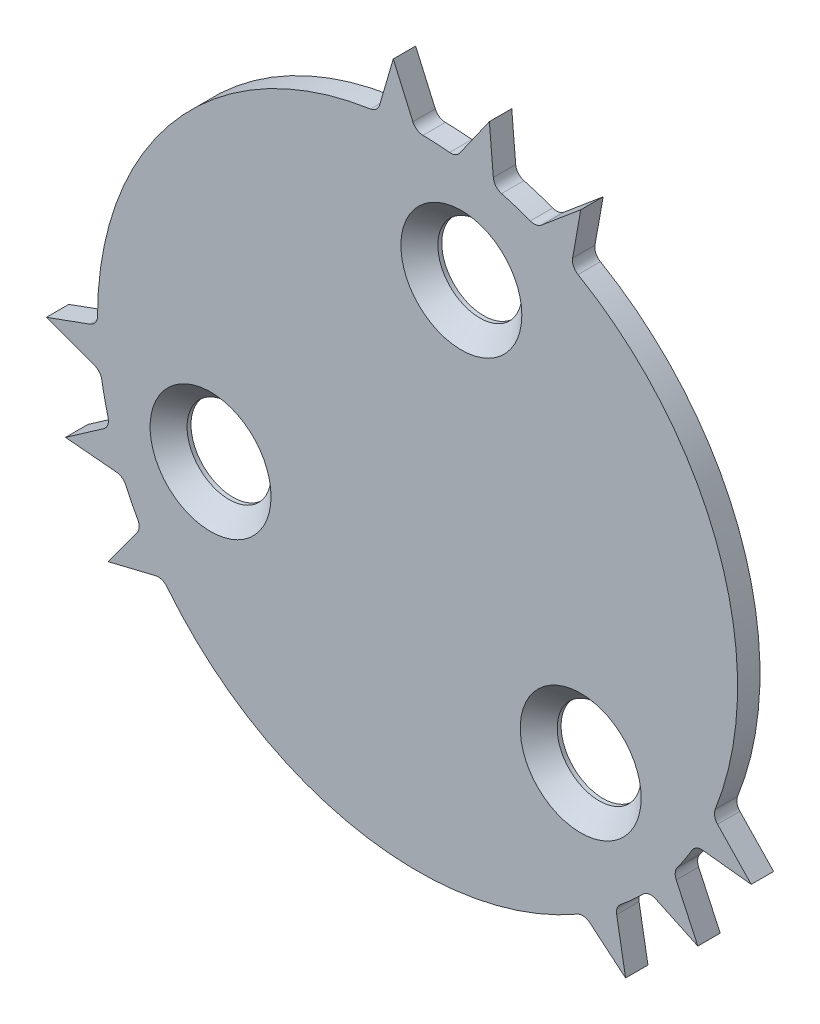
from build123d import *

# Parameters (mm, degrees)
SKIZZE1_R                     = 28.582568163
LINEAR_AUSTRAGEN2_DEPTH       = 2
LINEAR_START                  = -2
LINEAR_AUSTRAGEN3_DEPTH       = 2
VERRUNDUNG1_R                 = 1
KREISMUSTER5_COUNT            = 3
VERRUNDUNG1_OF_KREISMUSTER5_R = 1


with BuildPart() as part:
    # Skizze1 → Linear austragen2 (new body)
    with BuildSketch(Plane.XY):
        Circle(SKIZZE1_R)
    extrude(amount=LINEAR_AUSTRAGEN2_DEPTH)

    # Skizze5 → Formsenkung f_r M5 SFHCS2 (revolve, cut)
    with BuildSketch(Plane(origin=(3.912466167, 19.084414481, 2), x_dir=(0, -1, 0), z_dir=(1, 0, 0))):
        Polygon((0, 0), (0, 2), (3.75, 2), (3.75, 1.65), (5.4, 0), align=None)
    formsenkung_f_r_m5_sfhcs2 = revolve(axis=Axis((3.912466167, 19.084414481, 8.35), (0, 0, -1)), mode=Mode.SUBTRACT)

    # Skizze6 → Linear austragen3 (add)
    with BuildSketch(Plane.XY.offset(2).offset(LINEAR_START)):
        with BuildLine():
            Line((14.571015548, 29.864811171), (13.725776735, 25.07122366))
            ThreePointArc((13.725776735, 25.07122366), (12.189743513, 25.852917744), (10.609388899, 26.540611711))
            Line((10.609388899, 26.540611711), (14.571015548, 29.864811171))
        make_face()
        with BuildLine():
            Line((6.41322251, 32.605091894), (6.827302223, 27.755200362))
            ThreePointArc((6.827302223, 27.755200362), (5.142043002, 28.116233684), (3.43808753, 28.375037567))
            Line((3.43808753, 28.375037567), (6.41322251, 32.605091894))
        make_face()
        with BuildLine():
            Line((-2.168939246, 33.15896776), (-0.155812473, 28.582143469))
            ThreePointArc((-0.155812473, 28.582143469), (-1.865608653, 28.521618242), (-3.568720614, 28.358903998))
            Line((-3.568720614, 28.358903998), (-2.168939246, 33.15896776))
        make_face()
    linear_austragen3 = extrude(amount=LINEAR_AUSTRAGEN3_DEPTH)

    # Verrundung1
    verrundung1_edges = [part.edges().sort_by_distance(p)[0] for p in [
        (10.609388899, 26.540611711, 1),
        (13.725776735, 25.07122366, 1),
        (3.43808753, 28.375037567, 1),
        (6.827302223, 27.755200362, 1),
        (-3.568720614, 28.358903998, 1),
        (-0.155812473, 28.582143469, 1),
    ]]
    fillet(verrundung1_edges, radius=VERRUNDUNG1_R)

    # Kreismuster5: Formsenkung f_r M5 SFHCS2, Linear austragen3 ×3 about axis
    kreismuster5_axis = Axis((0, 0, 0), (0, 0, 1))
    add([formsenkung_f_r_m5_sfhcs2.rotate(kreismuster5_axis, i * 360 / KREISMUSTER5_COUNT) for i in range(1, KREISMUSTER5_COUNT)], mode=Mode.SUBTRACT)
    add([linear_austragen3.rotate(kreismuster5_axis, i * 360 / KREISMUSTER5_COUNT) for i in range(1, KREISMUSTER5_COUNT)])

    # Verrundung1 of Kreismuster5
    verrundung1_of_kreismuster5_edges = [part.edges().sort_by_distance(p)[0] for p in [
        (-28.289538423, -4.082305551, 1),
        (-28.575204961, -0.648740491, 1),
        (-26.292547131, -11.210047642, 1),
        (-27.450359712, -7.964983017, 1),
        (-22.775170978, -17.27005471, 1),
        (-24.674956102, -14.426009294, 1),
        (17.680149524, -22.45830616, 1),
        (14.849428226, -24.422483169, 1),
        (22.854459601, -17.164989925, 1),
        (20.623057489, -19.790217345, 1),
        (26.343891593, -11.088849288, 1),
        (24.830768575, -14.156134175, 1),
    ]]
    fillet(verrundung1_of_kreismuster5_edges, radius=VERRUNDUNG1_OF_KREISMUSTER5_R)


solid = part.part
